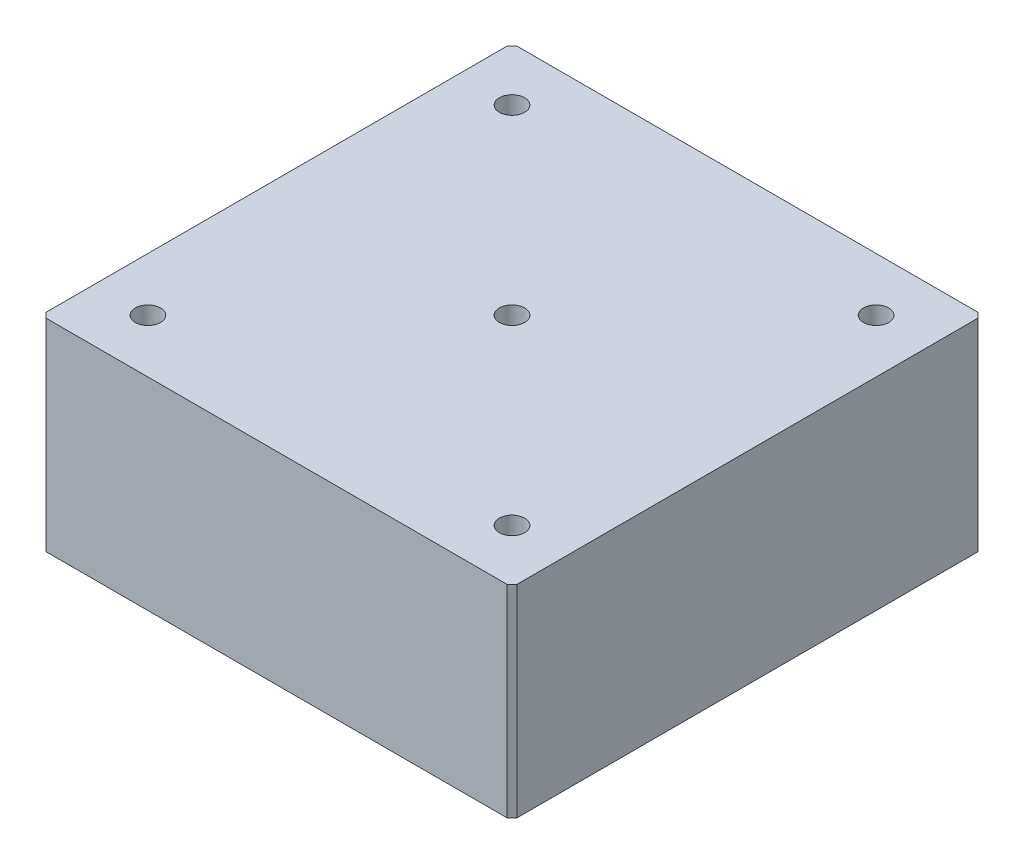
from build123d import *

# Parameters (mm, degrees)
SKETCH1_W                                    = 295.76776
SKETCH1_H                                    = 295.76776
BOSS_EXTRUDE1_DEPTH                          = 63.5
CHAMFER1_SIZE                                = 3.175
CBORE_FOR_1_4_HEX_MACHINE_SCREW2_D           = 6.7564
CBORE_FOR_1_4_HEX_MACHINE_SCREW2_CBORE_D     = 15.875
CBORE_FOR_1_4_HEX_MACHINE_SCREW2_CBORE_DEPTH = 74.676


with BuildPart() as part:
    # Sketch1 → Boss-Extrude1 (new, symmetric)
    with BuildSketch(Plane(origin=(0, 0, 0), x_dir=(1, 0, 0), z_dir=(0, 1, 0))):
        Rectangle(SKETCH1_W, SKETCH1_H)
    extrude(amount=BOSS_EXTRUDE1_DEPTH, both=True)

    # Chamfer1
    chamfer1_edges = [part.edges().sort_by_distance(p)[0] for p in [
        (147.88388, 0, 147.88388),
        (-147.88388, 0, 147.88388),
        (-147.88388, 0, -147.88388),
        (147.88388, 0, -147.88388),
    ]]
    chamfer(chamfer1_edges, length=CHAMFER1_SIZE)

    # CBORE for 1_4 Hex Machine Screw2 (through all)
    with Locations(Plane(origin=(0, 63.5, 0), x_dir=(-1, 0, 0), z_dir=(0, 1, 0))):
        with Locations((-114.3, -114.3), (-114.3, 114.3), (0, 0), (114.3, -114.3), (114.3, 114.3)):
            CounterBoreHole(CBORE_FOR_1_4_HEX_MACHINE_SCREW2_D / 2, CBORE_FOR_1_4_HEX_MACHINE_SCREW2_CBORE_D / 2, CBORE_FOR_1_4_HEX_MACHINE_SCREW2_CBORE_DEPTH)


solid = part.part
